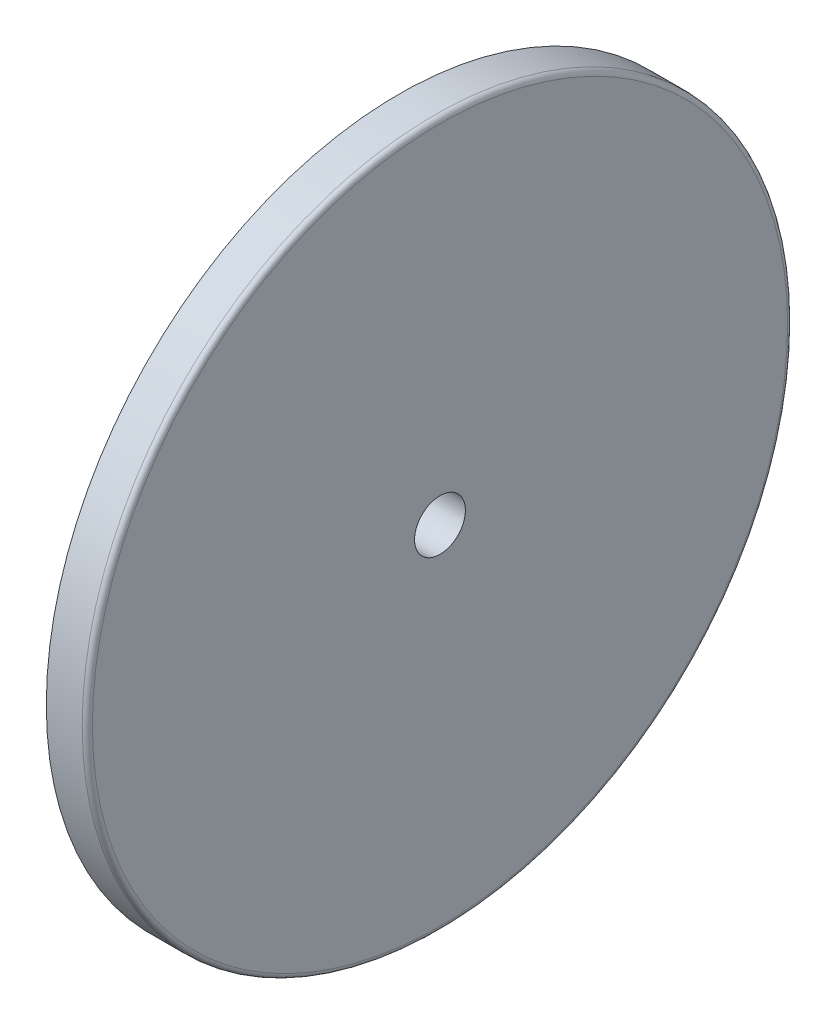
ISO-10303-21;
HEADER;
FILE_DESCRIPTION(('STEP AP214'),'2;1');
FILE_NAME('part.step','',(''),(''),'','','');
FILE_SCHEMA(('AUTOMOTIVE_DESIGN { 1 0 10303 214 1 1 1 1 }'));
ENDSEC;
DATA;
#1=APPLICATION_CONTEXT('core data for automotive mechanical design processes');
#2=APPLICATION_PROTOCOL_DEFINITION('international standard','automotive_design',2000,#1);
#3=PRODUCT_CONTEXT('',#1,'mechanical');
#4=PRODUCT('Part','Part','',(#3));
#5=PRODUCT_RELATED_PRODUCT_CATEGORY('part','',(#4));
#6=PRODUCT_DEFINITION_FORMATION('','',#4);
#7=PRODUCT_DEFINITION_CONTEXT('part definition',#1,'design');
#8=PRODUCT_DEFINITION('design','',#6,#7);
#9=PRODUCT_DEFINITION_SHAPE('','',#8);
#10=(LENGTH_UNIT() NAMED_UNIT(*) SI_UNIT(.MILLI.,.METRE.));
#11=(NAMED_UNIT(*) PLANE_ANGLE_UNIT() SI_UNIT($,.RADIAN.));
#12=(NAMED_UNIT(*) SI_UNIT($,.STERADIAN.) SOLID_ANGLE_UNIT());
#13=UNCERTAINTY_MEASURE_WITH_UNIT(LENGTH_MEASURE(1.E-05),#10,'distance_accuracy_value','');
#14=(GEOMETRIC_REPRESENTATION_CONTEXT(3) GLOBAL_UNCERTAINTY_ASSIGNED_CONTEXT((#13)) GLOBAL_UNIT_ASSIGNED_CONTEXT((#10,
#11,#12)) REPRESENTATION_CONTEXT('',''));
#15=CARTESIAN_POINT('',(0.,0.,0.));
#16=DIRECTION('',(0.,0.,1.));
#17=DIRECTION('',(1.,0.,0.));
#18=AXIS2_PLACEMENT_3D('',#15,#16,#17);
#19=CARTESIAN_POINT('',(4.04495000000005,0.,0.));
#20=DIRECTION('',(-1.,0.,0.));
#21=DIRECTION('',(0.,0.,1.));
#22=AXIS2_PLACEMENT_3D('',#19,#20,#21);
#23=TOROIDAL_SURFACE('',#22,24.5745,0.79375);
#24=CARTESIAN_POINT('',(3.25120000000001,0.,0.));
#25=DIRECTION('',(-1.,0.,0.));
#26=DIRECTION('',(0.,0.,1.));
#27=AXIS2_PLACEMENT_3D('',#24,#25,#26);
#28=CIRCLE('',#27,24.5745);
#29=CARTESIAN_POINT('',(3.25120000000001,0.,24.5745));
#30=VERTEX_POINT('',#29);
#31=EDGE_CURVE('E10',#30,#30,#28,.T.);
#32=ORIENTED_EDGE('',*,*,#31,.F.);
#33=EDGE_LOOP('',(#32));
#34=FACE_BOUND('',#33,.T.);
#35=CARTESIAN_POINT('',(4.04495000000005,0.,0.));
#36=DIRECTION('',(-1.,0.,0.));
#37=DIRECTION('',(0.,0.,1.));
#38=AXIS2_PLACEMENT_3D('',#35,#36,#37);
#39=CIRCLE('',#38,25.36825);
#40=CARTESIAN_POINT('',(4.04495000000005,0.,25.36825));
#41=VERTEX_POINT('',#40);
#42=EDGE_CURVE('E104',#41,#41,#39,.T.);
#43=ORIENTED_EDGE('',*,*,#42,.T.);
#44=EDGE_LOOP('',(#43));
#45=FACE_BOUND('',#44,.T.);
#46=ADVANCED_FACE('F36',(#34,#45),#23,.T.);
#47=CARTESIAN_POINT('',(3.25120000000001,24.5745,0.));
#48=DIRECTION('',(1.,0.,0.));
#49=DIRECTION('',(0.,0.,-1.));
#50=AXIS2_PLACEMENT_3D('',#47,#48,#49);
#51=PLANE('',#50);
#52=CARTESIAN_POINT('',(3.25120000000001,0.,0.));
#53=DIRECTION('',(-1.,0.,0.));
#54=DIRECTION('',(0.,0.,1.));
#55=AXIS2_PLACEMENT_3D('',#52,#53,#54);
#56=CIRCLE('',#55,3.96875);
#57=CARTESIAN_POINT('',(3.25120000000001,0.,3.96875));
#58=VERTEX_POINT('',#57);
#59=EDGE_CURVE('E43',#58,#58,#56,.T.);
#60=ORIENTED_EDGE('',*,*,#59,.F.);
#61=EDGE_LOOP('',(#60));
#62=FACE_BOUND('',#61,.T.);
#63=ORIENTED_EDGE('',*,*,#31,.T.);
#64=EDGE_LOOP('',(#63));
#65=FACE_BOUND('',#64,.T.);
#66=ADVANCED_FACE('F189',(#62,#65),#51,.F.);
#67=CARTESIAN_POINT('',(0.,0.,0.));
#68=DIRECTION('',(-1.,0.,0.));
#69=DIRECTION('',(0.,0.,1.));
#70=AXIS2_PLACEMENT_3D('',#67,#68,#69);
#71=CYLINDRICAL_SURFACE('',#70,3.96875);
#72=CARTESIAN_POINT('',(11.4,0.,0.));
#73=DIRECTION('',(-1.,0.,0.));
#74=DIRECTION('',(0.,0.,1.));
#75=AXIS2_PLACEMENT_3D('',#72,#73,#74);
#76=CIRCLE('',#75,3.96875);
#77=CARTESIAN_POINT('',(11.4,0.,3.96875));
#78=VERTEX_POINT('',#77);
#79=EDGE_CURVE('E50',#78,#78,#76,.T.);
#80=ORIENTED_EDGE('',*,*,#79,.F.);
#81=EDGE_LOOP('',(#80));
#82=FACE_BOUND('',#81,.T.);
#83=ORIENTED_EDGE('',*,*,#59,.T.);
#84=EDGE_LOOP('',(#83));
#85=FACE_BOUND('',#84,.T.);
#86=ADVANCED_FACE('F184',(#82,#85),#71,.F.);
#87=CARTESIAN_POINT('',(11.4,54.24805,0.));
#88=DIRECTION('',(-1.,0.,0.));
#89=DIRECTION('',(0.,0.,1.));
#90=AXIS2_PLACEMENT_3D('',#87,#88,#89);
#91=PLANE('',#90);
#92=CARTESIAN_POINT('',(11.4,0.,0.));
#93=DIRECTION('',(-1.,0.,0.));
#94=DIRECTION('',(0.,0.,1.));
#95=AXIS2_PLACEMENT_3D('',#92,#93,#94);
#96=CIRCLE('',#95,54.24805);
#97=CARTESIAN_POINT('',(11.4,0.,54.24805));
#98=VERTEX_POINT('',#97);
#99=EDGE_CURVE('E54',#98,#98,#96,.T.);
#100=ORIENTED_EDGE('',*,*,#99,.F.);
#101=EDGE_LOOP('',(#100));
#102=FACE_BOUND('',#101,.T.);
#103=ORIENTED_EDGE('',*,*,#79,.T.);
#104=EDGE_LOOP('',(#103));
#105=FACE_BOUND('',#104,.T.);
#106=ADVANCED_FACE('F178',(#102,#105),#91,.F.);
#107=CARTESIAN_POINT('',(10.60625,0.,0.));
#108=DIRECTION('',(-1.,0.,0.));
#109=DIRECTION('',(0.,0.,1.));
#110=AXIS2_PLACEMENT_3D('',#107,#108,#109);
#111=TOROIDAL_SURFACE('',#110,54.24805,0.793750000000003);
#112=CARTESIAN_POINT('',(10.60625,0.,0.));
#113=DIRECTION('',(-1.,0.,0.));
#114=DIRECTION('',(0.,0.,1.));
#115=AXIS2_PLACEMENT_3D('',#112,#113,#114);
#116=CIRCLE('',#115,55.0418);
#117=CARTESIAN_POINT('',(10.60625,0.,55.0418));
#118=VERTEX_POINT('',#117);
#119=EDGE_CURVE('E60',#118,#118,#116,.T.);
#120=ORIENTED_EDGE('',*,*,#119,.F.);
#121=EDGE_LOOP('',(#120));
#122=FACE_BOUND('',#121,.T.);
#123=ORIENTED_EDGE('',*,*,#99,.T.);
#124=EDGE_LOOP('',(#123));
#125=FACE_BOUND('',#124,.T.);
#126=ADVANCED_FACE('F172',(#122,#125),#111,.T.);
#127=CARTESIAN_POINT('',(0.,0.,0.));
#128=DIRECTION('',(-1.,0.,0.));
#129=DIRECTION('',(0.,0.,1.));
#130=AXIS2_PLACEMENT_3D('',#127,#128,#129);
#131=CYLINDRICAL_SURFACE('',#130,55.0418);
#132=CARTESIAN_POINT('',(5.0038,0.,0.));
#133=DIRECTION('',(-1.,0.,0.));
#134=DIRECTION('',(0.,0.,1.));
#135=AXIS2_PLACEMENT_3D('',#132,#133,#134);
#136=CIRCLE('',#135,55.0418);
#137=CARTESIAN_POINT('',(5.0038,0.,55.0418));
#138=VERTEX_POINT('',#137);
#139=EDGE_CURVE('E64',#138,#138,#136,.T.);
#140=ORIENTED_EDGE('',*,*,#139,.F.);
#141=EDGE_LOOP('',(#140));
#142=FACE_BOUND('',#141,.T.);
#143=ORIENTED_EDGE('',*,*,#119,.T.);
#144=EDGE_LOOP('',(#143));
#145=FACE_BOUND('',#144,.T.);
#146=ADVANCED_FACE('F166',(#142,#145),#131,.T.);
#147=CARTESIAN_POINT('',(5.0038,55.0418,0.));
#148=DIRECTION('',(1.,0.,0.));
#149=DIRECTION('',(0.,0.,-1.));
#150=AXIS2_PLACEMENT_3D('',#147,#148,#149);
#151=PLANE('',#150);
#152=CARTESIAN_POINT('',(5.0038,0.,0.));
#153=DIRECTION('',(-1.,0.,0.));
#154=DIRECTION('',(0.,0.,1.));
#155=AXIS2_PLACEMENT_3D('',#152,#153,#154);
#156=CIRCLE('',#155,54.102);
#157=CARTESIAN_POINT('',(5.0038,0.,54.102));
#158=VERTEX_POINT('',#157);
#159=EDGE_CURVE('E68',#158,#158,#156,.T.);
#160=ORIENTED_EDGE('',*,*,#159,.F.);
#161=EDGE_LOOP('',(#160));
#162=FACE_BOUND('',#161,.T.);
#163=ORIENTED_EDGE('',*,*,#139,.T.);
#164=EDGE_LOOP('',(#163));
#165=FACE_BOUND('',#164,.T.);
#166=ADVANCED_FACE('F160',(#162,#165),#151,.F.);
#167=CARTESIAN_POINT('',(0.,0.,0.));
#168=DIRECTION('',(-1.,0.,0.));
#169=DIRECTION('',(0.,0.,1.));
#170=AXIS2_PLACEMENT_3D('',#167,#168,#169);
#171=CYLINDRICAL_SURFACE('',#170,54.102);
#172=CARTESIAN_POINT('',(10.0076,0.,0.));
#173=DIRECTION('',(-1.,0.,0.));
#174=DIRECTION('',(0.,0.,1.));
#175=AXIS2_PLACEMENT_3D('',#172,#173,#174);
#176=CIRCLE('',#175,54.102);
#177=CARTESIAN_POINT('',(10.0076,0.,54.102));
#178=VERTEX_POINT('',#177);
#179=EDGE_CURVE('E72',#178,#178,#176,.T.);
#180=ORIENTED_EDGE('',*,*,#179,.F.);
#181=EDGE_LOOP('',(#180));
#182=FACE_BOUND('',#181,.T.);
#183=ORIENTED_EDGE('',*,*,#159,.T.);
#184=EDGE_LOOP('',(#183));
#185=FACE_BOUND('',#184,.T.);
#186=ADVANCED_FACE('F154',(#182,#185),#171,.F.);
#187=CARTESIAN_POINT('',(10.0076,36.6395,0.));
#188=DIRECTION('',(1.,0.,0.));
#189=DIRECTION('',(0.,0.,-1.));
#190=AXIS2_PLACEMENT_3D('',#187,#188,#189);
#191=PLANE('',#190);
#192=CARTESIAN_POINT('',(10.0076,0.,0.));
#193=DIRECTION('',(-1.,0.,0.));
#194=DIRECTION('',(0.,0.,1.));
#195=AXIS2_PLACEMENT_3D('',#192,#193,#194);
#196=CIRCLE('',#195,36.6395);
#197=CARTESIAN_POINT('',(10.0076,0.,36.6395));
#198=VERTEX_POINT('',#197);
#199=EDGE_CURVE('E76',#198,#198,#196,.T.);
#200=ORIENTED_EDGE('',*,*,#199,.F.);
#201=EDGE_LOOP('',(#200));
#202=FACE_BOUND('',#201,.T.);
#203=ORIENTED_EDGE('',*,*,#179,.T.);
#204=EDGE_LOOP('',(#203));
#205=FACE_BOUND('',#204,.T.);
#206=ADVANCED_FACE('F148',(#202,#205),#191,.F.);
#207=CARTESIAN_POINT('',(0.,0.,0.));
#208=DIRECTION('',(-1.,0.,0.));
#209=DIRECTION('',(0.,0.,1.));
#210=AXIS2_PLACEMENT_3D('',#207,#208,#209);
#211=CYLINDRICAL_SURFACE('',#210,36.6395);
#212=CARTESIAN_POINT('',(5.74039999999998,0.,0.));
#213=DIRECTION('',(-1.,0.,0.));
#214=DIRECTION('',(0.,0.,1.));
#215=AXIS2_PLACEMENT_3D('',#212,#213,#214);
#216=CIRCLE('',#215,36.6395);
#217=CARTESIAN_POINT('',(5.74039999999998,0.,36.6395));
#218=VERTEX_POINT('',#217);
#219=EDGE_CURVE('E80',#218,#218,#216,.T.);
#220=ORIENTED_EDGE('',*,*,#219,.F.);
#221=EDGE_LOOP('',(#220));
#222=FACE_BOUND('',#221,.T.);
#223=ORIENTED_EDGE('',*,*,#199,.T.);
#224=EDGE_LOOP('',(#223));
#225=FACE_BOUND('',#224,.T.);
#226=ADVANCED_FACE('F142',(#222,#225),#211,.T.);
#227=CARTESIAN_POINT('',(5.74039999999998,31.369,0.));
#228=DIRECTION('',(1.,0.,0.));
#229=DIRECTION('',(0.,0.,-1.));
#230=AXIS2_PLACEMENT_3D('',#227,#228,#229);
#231=PLANE('',#230);
#232=CARTESIAN_POINT('',(5.74039999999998,0.,0.));
#233=DIRECTION('',(-1.,0.,0.));
#234=DIRECTION('',(0.,0.,1.));
#235=AXIS2_PLACEMENT_3D('',#232,#233,#234);
#236=CIRCLE('',#235,31.369);
#237=CARTESIAN_POINT('',(5.74039999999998,0.,31.369));
#238=VERTEX_POINT('',#237);
#239=EDGE_CURVE('E84',#238,#238,#236,.T.);
#240=ORIENTED_EDGE('',*,*,#239,.F.);
#241=EDGE_LOOP('',(#240));
#242=FACE_BOUND('',#241,.T.);
#243=ORIENTED_EDGE('',*,*,#219,.T.);
#244=EDGE_LOOP('',(#243));
#245=FACE_BOUND('',#244,.T.);
#246=ADVANCED_FACE('F136',(#242,#245),#231,.F.);
#247=CARTESIAN_POINT('',(0.,0.,0.));
#248=DIRECTION('',(-1.,0.,0.));
#249=DIRECTION('',(0.,0.,1.));
#250=AXIS2_PLACEMENT_3D('',#247,#248,#249);
#251=CYLINDRICAL_SURFACE('',#250,31.369);
#252=CARTESIAN_POINT('',(5.99439999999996,0.,0.));
#253=DIRECTION('',(-1.,0.,0.));
#254=DIRECTION('',(0.,0.,1.));
#255=AXIS2_PLACEMENT_3D('',#252,#253,#254);
#256=CIRCLE('',#255,31.369);
#257=CARTESIAN_POINT('',(5.99439999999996,0.,31.369));
#258=VERTEX_POINT('',#257);
#259=EDGE_CURVE('E88',#258,#258,#256,.T.);
#260=ORIENTED_EDGE('',*,*,#259,.F.);
#261=EDGE_LOOP('',(#260));
#262=FACE_BOUND('',#261,.T.);
#263=ORIENTED_EDGE('',*,*,#239,.T.);
#264=EDGE_LOOP('',(#263));
#265=FACE_BOUND('',#264,.T.);
#266=ADVANCED_FACE('F130',(#262,#265),#251,.F.);
#267=CARTESIAN_POINT('',(5.99439999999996,31.115,0.));
#268=DIRECTION('',(1.,0.,0.));
#269=DIRECTION('',(0.,0.,-1.));
#270=AXIS2_PLACEMENT_3D('',#267,#268,#269);
#271=PLANE('',#270);
#272=CARTESIAN_POINT('',(5.99439999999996,0.,0.));
#273=DIRECTION('',(-1.,0.,0.));
#274=DIRECTION('',(0.,0.,1.));
#275=AXIS2_PLACEMENT_3D('',#272,#273,#274);
#276=CIRCLE('',#275,31.115);
#277=CARTESIAN_POINT('',(5.99439999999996,0.,31.115));
#278=VERTEX_POINT('',#277);
#279=EDGE_CURVE('E92',#278,#278,#276,.T.);
#280=ORIENTED_EDGE('',*,*,#279,.F.);
#281=EDGE_LOOP('',(#280));
#282=FACE_BOUND('',#281,.T.);
#283=ORIENTED_EDGE('',*,*,#259,.T.);
#284=EDGE_LOOP('',(#283));
#285=FACE_BOUND('',#284,.T.);
#286=ADVANCED_FACE('F124',(#282,#285),#271,.F.);
#287=CARTESIAN_POINT('',(0.,0.,0.));
#288=DIRECTION('',(-1.,0.,0.));
#289=DIRECTION('',(0.,0.,1.));
#290=AXIS2_PLACEMENT_3D('',#287,#288,#289);
#291=CYLINDRICAL_SURFACE('',#290,31.115);
#292=CARTESIAN_POINT('',(5.97535000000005,0.,0.));
#293=DIRECTION('',(-1.,0.,0.));
#294=DIRECTION('',(0.,0.,1.));
#295=AXIS2_PLACEMENT_3D('',#292,#293,#294);
#296=CIRCLE('',#295,31.115);
#297=CARTESIAN_POINT('',(5.97535000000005,0.,31.115));
#298=VERTEX_POINT('',#297);
#299=EDGE_CURVE('E96',#298,#298,#296,.T.);
#300=ORIENTED_EDGE('',*,*,#299,.F.);
#301=EDGE_LOOP('',(#300));
#302=FACE_BOUND('',#301,.T.);
#303=ORIENTED_EDGE('',*,*,#279,.T.);
#304=EDGE_LOOP('',(#303));
#305=FACE_BOUND('',#304,.T.);
#306=ADVANCED_FACE('F118',(#302,#305),#291,.T.);
#307=CARTESIAN_POINT('',(5.97535000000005,25.36825,0.));
#308=DIRECTION('',(1.,0.,0.));
#309=DIRECTION('',(0.,0.,-1.));
#310=AXIS2_PLACEMENT_3D('',#307,#308,#309);
#311=PLANE('',#310);
#312=CARTESIAN_POINT('',(5.97535000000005,0.,0.));
#313=DIRECTION('',(-1.,0.,0.));
#314=DIRECTION('',(0.,0.,1.));
#315=AXIS2_PLACEMENT_3D('',#312,#313,#314);
#316=CIRCLE('',#315,25.36825);
#317=CARTESIAN_POINT('',(5.97535000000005,0.,25.36825));
#318=VERTEX_POINT('',#317);
#319=EDGE_CURVE('E100',#318,#318,#316,.T.);
#320=ORIENTED_EDGE('',*,*,#319,.F.);
#321=EDGE_LOOP('',(#320));
#322=FACE_BOUND('',#321,.T.);
#323=ORIENTED_EDGE('',*,*,#299,.T.);
#324=EDGE_LOOP('',(#323));
#325=FACE_BOUND('',#324,.T.);
#326=ADVANCED_FACE('F112',(#322,#325),#311,.F.);
#327=CARTESIAN_POINT('',(0.,0.,0.));
#328=DIRECTION('',(-1.,0.,0.));
#329=DIRECTION('',(0.,0.,1.));
#330=AXIS2_PLACEMENT_3D('',#327,#328,#329);
#331=CYLINDRICAL_SURFACE('',#330,25.36825);
#332=ORIENTED_EDGE('',*,*,#42,.F.);
#333=EDGE_LOOP('',(#332));
#334=FACE_BOUND('',#333,.T.);
#335=ORIENTED_EDGE('',*,*,#319,.T.);
#336=EDGE_LOOP('',(#335));
#337=FACE_BOUND('',#336,.T.);
#338=ADVANCED_FACE('F109',(#334,#337),#331,.T.);
#339=CLOSED_SHELL('',(#46,#66,#86,#106,#126,#146,#166,#186,#206,#226,#246,#266,#286,#306,#326,#338));
#340=MANIFOLD_SOLID_BREP('B2',#339);
#341=ADVANCED_BREP_SHAPE_REPRESENTATION('',(#18,#340),#14);
#342=SHAPE_DEFINITION_REPRESENTATION(#9,#341);
ENDSEC;
END-ISO-10303-21;
